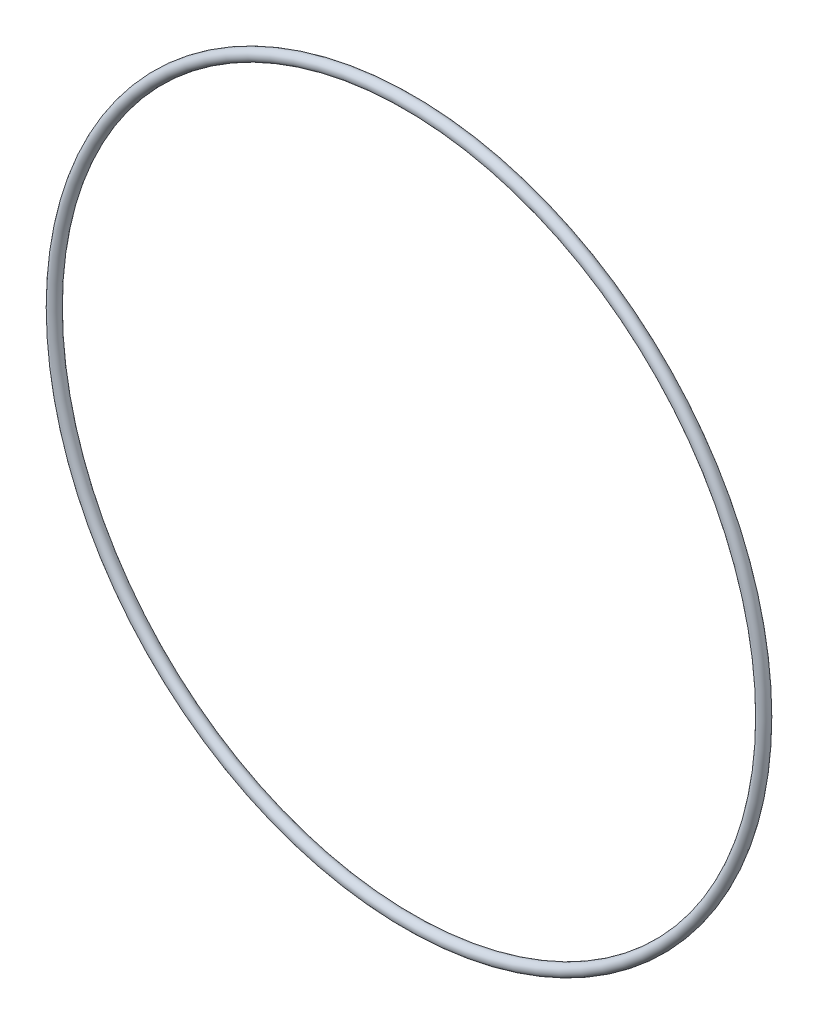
ISO-10303-21;
HEADER;
FILE_DESCRIPTION(('STEP AP214'),'2;1');
FILE_NAME('part.step','',(''),(''),'','','');
FILE_SCHEMA(('AUTOMOTIVE_DESIGN { 1 0 10303 214 1 1 1 1 }'));
ENDSEC;
DATA;
#1=APPLICATION_CONTEXT('core data for automotive mechanical design processes');
#2=APPLICATION_PROTOCOL_DEFINITION('international standard','automotive_design',2000,#1);
#3=PRODUCT_CONTEXT('',#1,'mechanical');
#4=PRODUCT('Part','Part','',(#3));
#5=PRODUCT_RELATED_PRODUCT_CATEGORY('part','',(#4));
#6=PRODUCT_DEFINITION_FORMATION('','',#4);
#7=PRODUCT_DEFINITION_CONTEXT('part definition',#1,'design');
#8=PRODUCT_DEFINITION('design','',#6,#7);
#9=PRODUCT_DEFINITION_SHAPE('','',#8);
#10=(LENGTH_UNIT() NAMED_UNIT(*) SI_UNIT(.MILLI.,.METRE.));
#11=(NAMED_UNIT(*) PLANE_ANGLE_UNIT() SI_UNIT($,.RADIAN.));
#12=(NAMED_UNIT(*) SI_UNIT($,.STERADIAN.) SOLID_ANGLE_UNIT());
#13=UNCERTAINTY_MEASURE_WITH_UNIT(LENGTH_MEASURE(1.E-05),#10,'distance_accuracy_value','');
#14=(GEOMETRIC_REPRESENTATION_CONTEXT(3) GLOBAL_UNCERTAINTY_ASSIGNED_CONTEXT((#13)) GLOBAL_UNIT_ASSIGNED_CONTEXT((#10,
#11,#12)) REPRESENTATION_CONTEXT('',''));
#15=CARTESIAN_POINT('',(0.,0.,0.));
#16=DIRECTION('',(0.,0.,1.));
#17=DIRECTION('',(1.,0.,0.));
#18=AXIS2_PLACEMENT_3D('',#15,#16,#17);
#19=CARTESIAN_POINT('',(0.,0.,0.));
#20=DIRECTION('',(0.,0.,1.));
#21=DIRECTION('',(1.,0.,0.));
#22=AXIS2_PLACEMENT_3D('',#19,#20,#21);
#23=TOROIDAL_SURFACE('',#22,109.5121,1.76529999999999);
#24=CARTESIAN_POINT('',(111.2774,0.,0.));
#25=VERTEX_POINT('',#24);
#26=VERTEX_LOOP('',#25);
#27=FACE_BOUND('',#26,.T.);
#28=ADVANCED_FACE('F28',(#27),#23,.T.);
#29=CLOSED_SHELL('',(#28));
#30=MANIFOLD_SOLID_BREP('B2',#29);
#31=ADVANCED_BREP_SHAPE_REPRESENTATION('',(#18,#30),#14);
#32=SHAPE_DEFINITION_REPRESENTATION(#9,#31);
ENDSEC;
END-ISO-10303-21;
